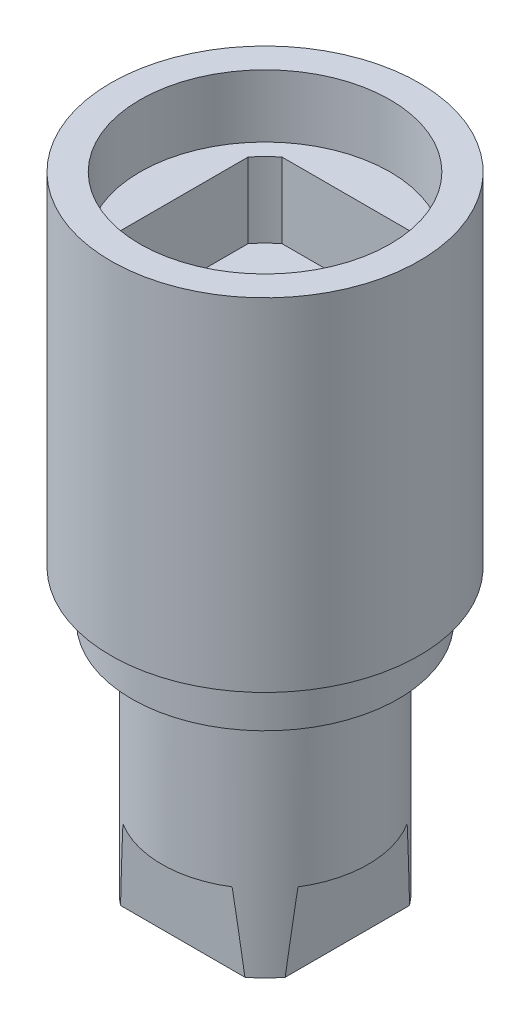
ISO-10303-21;
HEADER;
FILE_DESCRIPTION(('STEP AP214'),'2;1');
FILE_NAME('part.step','',(''),(''),'','','');
FILE_SCHEMA(('AUTOMOTIVE_DESIGN { 1 0 10303 214 1 1 1 1 }'));
ENDSEC;
DATA;
#1=APPLICATION_CONTEXT('core data for automotive mechanical design processes');
#2=APPLICATION_PROTOCOL_DEFINITION('international standard','automotive_design',2000,#1);
#3=PRODUCT_CONTEXT('',#1,'mechanical');
#4=PRODUCT('Part','Part','',(#3));
#5=PRODUCT_RELATED_PRODUCT_CATEGORY('part','',(#4));
#6=PRODUCT_DEFINITION_FORMATION('','',#4);
#7=PRODUCT_DEFINITION_CONTEXT('part definition',#1,'design');
#8=PRODUCT_DEFINITION('design','',#6,#7);
#9=PRODUCT_DEFINITION_SHAPE('','',#8);
#10=(LENGTH_UNIT() NAMED_UNIT(*) SI_UNIT(.MILLI.,.METRE.));
#11=(NAMED_UNIT(*) PLANE_ANGLE_UNIT() SI_UNIT($,.RADIAN.));
#12=(NAMED_UNIT(*) SI_UNIT($,.STERADIAN.) SOLID_ANGLE_UNIT());
#13=UNCERTAINTY_MEASURE_WITH_UNIT(LENGTH_MEASURE(1.E-05),#10,'distance_accuracy_value','');
#14=(GEOMETRIC_REPRESENTATION_CONTEXT(3) GLOBAL_UNCERTAINTY_ASSIGNED_CONTEXT((#13)) GLOBAL_UNIT_ASSIGNED_CONTEXT((#10,
#11,#12)) REPRESENTATION_CONTEXT('',''));
#15=CARTESIAN_POINT('',(0.,0.,0.));
#16=DIRECTION('',(0.,0.,1.));
#17=DIRECTION('',(1.,0.,0.));
#18=AXIS2_PLACEMENT_3D('',#15,#16,#17);
#19=CARTESIAN_POINT('',(0.,-13.6,0.));
#20=DIRECTION('',(0.,-1.,0.));
#21=DIRECTION('',(0.,0.,-1.));
#22=AXIS2_PLACEMENT_3D('',#19,#20,#21);
#23=PLANE('',#22);
#24=CARTESIAN_POINT('',(0.,-13.6,0.));
#25=DIRECTION('',(0.,1.,0.));
#26=DIRECTION('',(0.,0.,1.));
#27=AXIS2_PLACEMENT_3D('',#24,#25,#26);
#28=CIRCLE('',#27,3.1);
#29=CARTESIAN_POINT('',(-3.1,-13.6,0.));
#30=VERTEX_POINT('',#29);
#31=EDGE_CURVE('E32',#30,#30,#28,.T.);
#32=ORIENTED_EDGE('',*,*,#31,.T.);
#33=EDGE_LOOP('',(#32));
#34=FACE_BOUND('',#33,.T.);
#35=DIRECTION('',(0.,0.,1.));
#36=VECTOR('',#35,1.);
#37=CARTESIAN_POINT('',(-3.95,-13.6,8.88));
#38=LINE('',#37,#36);
#39=CARTESIAN_POINT('',(-3.95,-13.6,2.98328677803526));
#40=VERTEX_POINT('',#39);
#41=CARTESIAN_POINT('',(-3.95,-13.6,-2.98328677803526));
#42=VERTEX_POINT('',#41);
#43=EDGE_CURVE('E204',#40,#42,#38,.F.);
#44=ORIENTED_EDGE('',*,*,#43,.T.);
#45=CARTESIAN_POINT('',(0.,-13.6,0.));
#46=DIRECTION('',(0.,-1.,0.));
#47=DIRECTION('',(0.,0.,-1.));
#48=AXIS2_PLACEMENT_3D('',#45,#46,#47);
#49=CIRCLE('',#48,4.95);
#50=CARTESIAN_POINT('',(-2.98328677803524,-13.6,-3.95000000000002));
#51=VERTEX_POINT('',#50);
#52=EDGE_CURVE('E284',#42,#51,#49,.T.);
#53=ORIENTED_EDGE('',*,*,#52,.T.);
#54=DIRECTION('',(1.,0.,0.));
#55=VECTOR('',#54,1.);
#56=CARTESIAN_POINT('',(8.88,-13.6,-3.95000000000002));
#57=LINE('',#56,#55);
#58=CARTESIAN_POINT('',(2.98328677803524,-13.6,-3.95000000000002));
#59=VERTEX_POINT('',#58);
#60=EDGE_CURVE('E210',#51,#59,#57,.T.);
#61=ORIENTED_EDGE('',*,*,#60,.T.);
#62=CARTESIAN_POINT('',(0.,-13.6,0.));
#63=DIRECTION('',(0.,-1.,0.));
#64=DIRECTION('',(0.,0.,-1.));
#65=AXIS2_PLACEMENT_3D('',#62,#63,#64);
#66=CIRCLE('',#65,4.95);
#67=CARTESIAN_POINT('',(3.95000000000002,-13.6,-2.98328677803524));
#68=VERTEX_POINT('',#67);
#69=EDGE_CURVE('E19',#59,#68,#66,.T.);
#70=ORIENTED_EDGE('',*,*,#69,.T.);
#71=DIRECTION('',(0.,0.,1.));
#72=VECTOR('',#71,1.);
#73=CARTESIAN_POINT('',(3.95000000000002,-13.6,8.88));
#74=LINE('',#73,#72);
#75=CARTESIAN_POINT('',(3.95000000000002,-13.6,2.98328677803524));
#76=VERTEX_POINT('',#75);
#77=EDGE_CURVE('E215',#68,#76,#74,.T.);
#78=ORIENTED_EDGE('',*,*,#77,.T.);
#79=CARTESIAN_POINT('',(0.,-13.6,0.));
#80=DIRECTION('',(0.,-1.,0.));
#81=DIRECTION('',(0.,0.,-1.));
#82=AXIS2_PLACEMENT_3D('',#79,#80,#81);
#83=CIRCLE('',#82,4.95);
#84=CARTESIAN_POINT('',(2.98328677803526,-13.6,3.95));
#85=VERTEX_POINT('',#84);
#86=EDGE_CURVE('E287',#76,#85,#83,.T.);
#87=ORIENTED_EDGE('',*,*,#86,.T.);
#88=DIRECTION('',(1.,0.,0.));
#89=VECTOR('',#88,1.);
#90=CARTESIAN_POINT('',(8.88,-13.6,3.95));
#91=LINE('',#90,#89);
#92=CARTESIAN_POINT('',(-2.98328677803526,-13.6,3.95));
#93=VERTEX_POINT('',#92);
#94=EDGE_CURVE('E150',#85,#93,#91,.F.);
#95=ORIENTED_EDGE('',*,*,#94,.T.);
#96=CARTESIAN_POINT('',(0.,-13.6,0.));
#97=DIRECTION('',(0.,-1.,0.));
#98=DIRECTION('',(0.,0.,-1.));
#99=AXIS2_PLACEMENT_3D('',#96,#97,#98);
#100=CIRCLE('',#99,4.95);
#101=EDGE_CURVE('E286',#93,#40,#100,.T.);
#102=ORIENTED_EDGE('',*,*,#101,.T.);
#103=EDGE_LOOP('',(#44,#53,#61,#70,#78,#87,#95,#102));
#104=FACE_BOUND('',#103,.T.);
#105=ADVANCED_FACE('F16',(#34,#104),#23,.T.);
#106=CARTESIAN_POINT('',(0.,-13.6,0.));
#107=DIRECTION('',(0.,1.,0.));
#108=DIRECTION('',(0.,0.,1.));
#109=AXIS2_PLACEMENT_3D('',#106,#107,#108);
#110=CYLINDRICAL_SURFACE('',#109,3.1);
#111=ORIENTED_EDGE('',*,*,#31,.F.);
#112=EDGE_LOOP('',(#111));
#113=FACE_BOUND('',#112,.T.);
#114=CARTESIAN_POINT('',(0.,9.8,0.));
#115=DIRECTION('',(0.,1.,0.));
#116=DIRECTION('',(0.,0.,1.));
#117=AXIS2_PLACEMENT_3D('',#114,#115,#116);
#118=CIRCLE('',#117,3.1);
#119=CARTESIAN_POINT('',(-3.1,9.8,0.));
#120=VERTEX_POINT('',#119);
#121=EDGE_CURVE('E270',#120,#120,#118,.F.);
#122=ORIENTED_EDGE('',*,*,#121,.F.);
#123=EDGE_LOOP('',(#122));
#124=FACE_BOUND('',#123,.T.);
#125=ADVANCED_FACE('F300',(#113,#124),#110,.F.);
#126=CARTESIAN_POINT('',(8.88,-9.9,4.2));
#127=DIRECTION('',(0.,1.,0.));
#128=DIRECTION('',(0.,0.,1.));
#129=AXIS2_PLACEMENT_3D('',#126,#127,#128);
#130=PLANE('',#129);
#131=DIRECTION('',(1.,0.,0.));
#132=VECTOR('',#131,1.);
#133=CARTESIAN_POINT('',(8.88,-9.9,4.19999999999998));
#134=LINE('',#133,#132);
#135=CARTESIAN_POINT('',(-2.61963737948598,-9.9,4.19999999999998));
#136=VERTEX_POINT('',#135);
#137=CARTESIAN_POINT('',(2.61963737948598,-9.9,4.19999999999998));
#138=VERTEX_POINT('',#137);
#139=EDGE_CURVE('E202',#136,#138,#134,.T.);
#140=ORIENTED_EDGE('',*,*,#139,.T.);
#141=CARTESIAN_POINT('',(0.,-9.9,0.));
#142=DIRECTION('',(0.,-1.,0.));
#143=DIRECTION('',(0.,0.,-1.));
#144=AXIS2_PLACEMENT_3D('',#141,#142,#143);
#145=CIRCLE('',#144,4.95);
#146=EDGE_CURVE('E263',#136,#138,#145,.F.);
#147=ORIENTED_EDGE('',*,*,#146,.F.);
#148=EDGE_LOOP('',(#140,#147));
#149=FACE_BOUND('',#148,.T.);
#150=ADVANCED_FACE('F297',(#149),#130,.F.);
#151=CARTESIAN_POINT('',(4.95,-9.9,8.88));
#152=DIRECTION('',(0.,1.,0.));
#153=DIRECTION('',(0.,0.,1.));
#154=AXIS2_PLACEMENT_3D('',#151,#152,#153);
#155=PLANE('',#154);
#156=DIRECTION('',(0.,0.,1.));
#157=VECTOR('',#156,1.);
#158=CARTESIAN_POINT('',(4.2,-9.9,8.88));
#159=LINE('',#158,#157);
#160=CARTESIAN_POINT('',(4.2,-9.9,2.61963737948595));
#161=VERTEX_POINT('',#160);
#162=CARTESIAN_POINT('',(4.2,-9.9,-2.61963737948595));
#163=VERTEX_POINT('',#162);
#164=EDGE_CURVE('E82',#161,#163,#159,.F.);
#165=ORIENTED_EDGE('',*,*,#164,.T.);
#166=CARTESIAN_POINT('',(0.,-9.9,0.));
#167=DIRECTION('',(0.,-1.,0.));
#168=DIRECTION('',(0.,0.,-1.));
#169=AXIS2_PLACEMENT_3D('',#166,#167,#168);
#170=CIRCLE('',#169,4.95);
#171=EDGE_CURVE('E254',#161,#163,#170,.F.);
#172=ORIENTED_EDGE('',*,*,#171,.F.);
#173=EDGE_LOOP('',(#165,#172));
#174=FACE_BOUND('',#173,.T.);
#175=ADVANCED_FACE('F299',(#174),#155,.F.);
#176=CARTESIAN_POINT('',(4.2,-9.9,8.88));
#177=DIRECTION('',(-0.997725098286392,0.067413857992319,0.));
#178=DIRECTION('',(-0.067413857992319,-0.997725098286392,0.));
#179=AXIS2_PLACEMENT_3D('',#176,#177,#178);
#180=PLANE('',#179);
#181=CARTESIAN_POINT('',(0.,-72.0600000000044,0.));
#182=DIRECTION('',(-0.997725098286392,0.067413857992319,0.));
#183=DIRECTION('',(-0.067413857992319,-0.997725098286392,0.));
#184=AXIS2_PLACEMENT_3D('',#181,#182,#183);
#185=ELLIPSE('',#184,73.4270392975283,4.95);
#186=EDGE_CURVE('E252',#163,#68,#185,.T.);
#187=ORIENTED_EDGE('',*,*,#186,.F.);
#188=ORIENTED_EDGE('',*,*,#164,.F.);
#189=CARTESIAN_POINT('',(0.,-72.0600000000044,0.));
#190=DIRECTION('',(-0.997725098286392,0.067413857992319,0.));
#191=DIRECTION('',(-0.067413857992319,-0.997725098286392,0.));
#192=AXIS2_PLACEMENT_3D('',#189,#190,#191);
#193=ELLIPSE('',#192,73.4270392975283,4.95);
#194=EDGE_CURVE('E257',#76,#161,#193,.T.);
#195=ORIENTED_EDGE('',*,*,#194,.F.);
#196=ORIENTED_EDGE('',*,*,#77,.F.);
#197=EDGE_LOOP('',(#187,#188,#195,#196));
#198=FACE_BOUND('',#197,.T.);
#199=ADVANCED_FACE('F307',(#198),#180,.F.);
#200=CARTESIAN_POINT('',(8.88,-9.9,-4.95));
#201=DIRECTION('',(0.,1.,0.));
#202=DIRECTION('',(0.,0.,1.));
#203=AXIS2_PLACEMENT_3D('',#200,#201,#202);
#204=PLANE('',#203);
#205=DIRECTION('',(1.,0.,0.));
#206=VECTOR('',#205,1.);
#207=CARTESIAN_POINT('',(8.88,-9.9,-4.2));
#208=LINE('',#207,#206);
#209=CARTESIAN_POINT('',(2.61963737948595,-9.9,-4.2));
#210=VERTEX_POINT('',#209);
#211=CARTESIAN_POINT('',(-2.61963737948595,-9.9,-4.2));
#212=VERTEX_POINT('',#211);
#213=EDGE_CURVE('E212',#210,#212,#208,.F.);
#214=ORIENTED_EDGE('',*,*,#213,.T.);
#215=CARTESIAN_POINT('',(0.,-9.9,0.));
#216=DIRECTION('',(0.,-1.,0.));
#217=DIRECTION('',(0.,0.,-1.));
#218=AXIS2_PLACEMENT_3D('',#215,#216,#217);
#219=CIRCLE('',#218,4.95);
#220=EDGE_CURVE('E247',#210,#212,#219,.F.);
#221=ORIENTED_EDGE('',*,*,#220,.F.);
#222=EDGE_LOOP('',(#214,#221));
#223=FACE_BOUND('',#222,.T.);
#224=ADVANCED_FACE('F388',(#223),#204,.F.);
#225=CARTESIAN_POINT('',(8.88,-9.9,-4.2));
#226=DIRECTION('',(0.,0.067413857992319,0.997725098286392));
#227=DIRECTION('',(0.,-0.997725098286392,0.067413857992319));
#228=AXIS2_PLACEMENT_3D('',#225,#226,#227);
#229=PLANE('',#228);
#230=CARTESIAN_POINT('',(0.,-72.0600000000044,0.));
#231=DIRECTION('',(0.,0.067413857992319,0.997725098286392));
#232=DIRECTION('',(0.,-0.997725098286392,0.067413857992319));
#233=AXIS2_PLACEMENT_3D('',#230,#231,#232);
#234=ELLIPSE('',#233,73.4270392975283,4.95);
#235=EDGE_CURVE('E244',#212,#51,#234,.T.);
#236=ORIENTED_EDGE('',*,*,#235,.F.);
#237=ORIENTED_EDGE('',*,*,#213,.F.);
#238=CARTESIAN_POINT('',(0.,-72.0600000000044,0.));
#239=DIRECTION('',(0.,0.067413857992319,0.997725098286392));
#240=DIRECTION('',(0.,-0.997725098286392,0.067413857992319));
#241=AXIS2_PLACEMENT_3D('',#238,#239,#240);
#242=ELLIPSE('',#241,73.4270392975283,4.95);
#243=EDGE_CURVE('E250',#59,#210,#242,.T.);
#244=ORIENTED_EDGE('',*,*,#243,.F.);
#245=ORIENTED_EDGE('',*,*,#60,.F.);
#246=EDGE_LOOP('',(#236,#237,#244,#245));
#247=FACE_BOUND('',#246,.T.);
#248=ADVANCED_FACE('F384',(#247),#229,.F.);
#249=CARTESIAN_POINT('',(-4.2,-9.9,8.88));
#250=DIRECTION('',(0.,1.,0.));
#251=DIRECTION('',(0.,0.,1.));
#252=AXIS2_PLACEMENT_3D('',#249,#250,#251);
#253=PLANE('',#252);
#254=DIRECTION('',(0.,0.,1.));
#255=VECTOR('',#254,1.);
#256=CARTESIAN_POINT('',(-4.19999999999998,-9.9,8.88));
#257=LINE('',#256,#255);
#258=CARTESIAN_POINT('',(-4.19999999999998,-9.9,-2.61963737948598));
#259=VERTEX_POINT('',#258);
#260=CARTESIAN_POINT('',(-4.19999999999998,-9.9,2.61963737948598));
#261=VERTEX_POINT('',#260);
#262=EDGE_CURVE('E207',#259,#261,#257,.T.);
#263=ORIENTED_EDGE('',*,*,#262,.T.);
#264=CARTESIAN_POINT('',(0.,-9.9,0.));
#265=DIRECTION('',(0.,-1.,0.));
#266=DIRECTION('',(0.,0.,-1.));
#267=AXIS2_PLACEMENT_3D('',#264,#265,#266);
#268=CIRCLE('',#267,4.95);
#269=EDGE_CURVE('E238',#259,#261,#268,.F.);
#270=ORIENTED_EDGE('',*,*,#269,.F.);
#271=EDGE_LOOP('',(#263,#270));
#272=FACE_BOUND('',#271,.T.);
#273=ADVANCED_FACE('F380',(#272),#253,.F.);
#274=CARTESIAN_POINT('',(-3.95,-13.6,8.88));
#275=DIRECTION('',(0.997725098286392,0.067413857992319,0.));
#276=DIRECTION('',(-0.067413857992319,0.997725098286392,0.));
#277=AXIS2_PLACEMENT_3D('',#274,#275,#276);
#278=PLANE('',#277);
#279=CARTESIAN_POINT('',(0.,-72.0600000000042,0.));
#280=DIRECTION('',(0.997725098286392,0.067413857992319,0.));
#281=DIRECTION('',(0.067413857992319,-0.997725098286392,0.));
#282=AXIS2_PLACEMENT_3D('',#279,#280,#281);
#283=ELLIPSE('',#282,73.4270392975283,4.95);
#284=EDGE_CURVE('E235',#261,#40,#283,.T.);
#285=ORIENTED_EDGE('',*,*,#284,.F.);
#286=ORIENTED_EDGE('',*,*,#262,.F.);
#287=CARTESIAN_POINT('',(0.,-72.0600000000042,0.));
#288=DIRECTION('',(0.997725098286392,0.067413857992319,0.));
#289=DIRECTION('',(0.067413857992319,-0.997725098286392,0.));
#290=AXIS2_PLACEMENT_3D('',#287,#288,#289);
#291=ELLIPSE('',#290,73.4270392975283,4.95);
#292=EDGE_CURVE('E241',#42,#259,#291,.T.);
#293=ORIENTED_EDGE('',*,*,#292,.F.);
#294=ORIENTED_EDGE('',*,*,#43,.F.);
#295=EDGE_LOOP('',(#285,#286,#293,#294));
#296=FACE_BOUND('',#295,.T.);
#297=ADVANCED_FACE('F377',(#296),#278,.F.);
#298=CARTESIAN_POINT('',(8.88,-13.6,3.95));
#299=DIRECTION('',(0.,0.067413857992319,-0.997725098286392));
#300=DIRECTION('',(0.,0.997725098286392,0.067413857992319));
#301=AXIS2_PLACEMENT_3D('',#298,#299,#300);
#302=PLANE('',#301);
#303=CARTESIAN_POINT('',(0.,-72.0600000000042,0.));
#304=DIRECTION('',(0.,0.067413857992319,-0.997725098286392));
#305=DIRECTION('',(0.,-0.997725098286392,-0.067413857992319));
#306=AXIS2_PLACEMENT_3D('',#303,#304,#305);
#307=ELLIPSE('',#306,73.4270392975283,4.95);
#308=EDGE_CURVE('E260',#138,#85,#307,.T.);
#309=ORIENTED_EDGE('',*,*,#308,.F.);
#310=ORIENTED_EDGE('',*,*,#139,.F.);
#311=CARTESIAN_POINT('',(0.,-72.0600000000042,0.));
#312=DIRECTION('',(0.,0.067413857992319,-0.997725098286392));
#313=DIRECTION('',(0.,-0.997725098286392,-0.067413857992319));
#314=AXIS2_PLACEMENT_3D('',#311,#312,#313);
#315=ELLIPSE('',#314,73.4270392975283,4.95);
#316=EDGE_CURVE('E192',#93,#136,#315,.T.);
#317=ORIENTED_EDGE('',*,*,#316,.F.);
#318=ORIENTED_EDGE('',*,*,#94,.F.);
#319=EDGE_LOOP('',(#309,#310,#317,#318));
#320=FACE_BOUND('',#319,.T.);
#321=ADVANCED_FACE('F293',(#320),#302,.F.);
#322=CARTESIAN_POINT('',(0.,16.4,0.));
#323=DIRECTION('',(0.,1.,0.));
#324=DIRECTION('',(0.,0.,1.));
#325=AXIS2_PLACEMENT_3D('',#322,#323,#324);
#326=CYLINDRICAL_SURFACE('',#325,5.15);
#327=DIRECTION('',(0.,1.,0.));
#328=VECTOR('',#327,1.);
#329=CARTESIAN_POINT('',(-3.212767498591,16.4,4.025));
#330=LINE('',#329,#328);
#331=CARTESIAN_POINT('',(-3.21276749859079,13.4,4.025));
#332=VERTEX_POINT('',#331);
#333=CARTESIAN_POINT('',(-3.21276749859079,9.8,4.025));
#334=VERTEX_POINT('',#333);
#335=EDGE_CURVE('E160',#332,#334,#330,.F.);
#336=ORIENTED_EDGE('',*,*,#335,.T.);
#337=CARTESIAN_POINT('',(0.,9.8,0.));
#338=DIRECTION('',(0.,1.,0.));
#339=DIRECTION('',(0.,0.,1.));
#340=AXIS2_PLACEMENT_3D('',#337,#338,#339);
#341=CIRCLE('',#340,5.15);
#342=CARTESIAN_POINT('',(-4.025,9.8,3.21276749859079));
#343=VERTEX_POINT('',#342);
#344=EDGE_CURVE('E156',#343,#334,#341,.T.);
#345=ORIENTED_EDGE('',*,*,#344,.F.);
#346=DIRECTION('',(0.,1.,0.));
#347=VECTOR('',#346,1.);
#348=CARTESIAN_POINT('',(-4.025,16.4,3.212767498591));
#349=LINE('',#348,#347);
#350=CARTESIAN_POINT('',(-4.025,13.4,3.21276749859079));
#351=VERTEX_POINT('',#350);
#352=EDGE_CURVE('E153',#343,#351,#349,.T.);
#353=ORIENTED_EDGE('',*,*,#352,.T.);
#354=CARTESIAN_POINT('',(0.,13.4,0.));
#355=DIRECTION('',(0.,1.,0.));
#356=DIRECTION('',(0.,0.,1.));
#357=AXIS2_PLACEMENT_3D('',#354,#355,#356);
#358=CIRCLE('',#357,5.15);
#359=EDGE_CURVE('E138',#332,#351,#358,.F.);
#360=ORIENTED_EDGE('',*,*,#359,.F.);
#361=EDGE_LOOP('',(#336,#345,#353,#360));
#362=FACE_BOUND('',#361,.T.);
#363=ADVANCED_FACE('F154',(#362),#326,.F.);
#364=CARTESIAN_POINT('',(0.,16.4,0.));
#365=DIRECTION('',(0.,1.,0.));
#366=DIRECTION('',(0.,0.,1.));
#367=AXIS2_PLACEMENT_3D('',#364,#365,#366);
#368=CYLINDRICAL_SURFACE('',#367,5.15);
#369=DIRECTION('',(0.,1.,0.));
#370=VECTOR('',#369,1.);
#371=CARTESIAN_POINT('',(4.025,16.4,3.212767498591));
#372=LINE('',#371,#370);
#373=CARTESIAN_POINT('',(4.025,13.4,3.21276749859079));
#374=VERTEX_POINT('',#373);
#375=CARTESIAN_POINT('',(4.025,9.8,3.21276749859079));
#376=VERTEX_POINT('',#375);
#377=EDGE_CURVE('E182',#374,#376,#372,.F.);
#378=ORIENTED_EDGE('',*,*,#377,.T.);
#379=CARTESIAN_POINT('',(0.,9.8,0.));
#380=DIRECTION('',(0.,1.,0.));
#381=DIRECTION('',(0.,0.,1.));
#382=AXIS2_PLACEMENT_3D('',#379,#380,#381);
#383=CIRCLE('',#382,5.15);
#384=CARTESIAN_POINT('',(3.21276749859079,9.8,4.025));
#385=VERTEX_POINT('',#384);
#386=EDGE_CURVE('E276',#385,#376,#383,.T.);
#387=ORIENTED_EDGE('',*,*,#386,.F.);
#388=DIRECTION('',(0.,1.,0.));
#389=VECTOR('',#388,1.);
#390=CARTESIAN_POINT('',(3.212767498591,16.4,4.025));
#391=LINE('',#390,#389);
#392=CARTESIAN_POINT('',(3.21276749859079,13.4,4.025));
#393=VERTEX_POINT('',#392);
#394=EDGE_CURVE('E185',#385,#393,#391,.T.);
#395=ORIENTED_EDGE('',*,*,#394,.T.);
#396=CARTESIAN_POINT('',(0.,13.4,0.));
#397=DIRECTION('',(0.,1.,0.));
#398=DIRECTION('',(0.,0.,1.));
#399=AXIS2_PLACEMENT_3D('',#396,#397,#398);
#400=CIRCLE('',#399,5.15);
#401=EDGE_CURVE('E149',#374,#393,#400,.F.);
#402=ORIENTED_EDGE('',*,*,#401,.F.);
#403=EDGE_LOOP('',(#378,#387,#395,#402));
#404=FACE_BOUND('',#403,.T.);
#405=ADVANCED_FACE('F368',(#404),#368,.F.);
#406=CARTESIAN_POINT('',(0.,16.4,0.));
#407=DIRECTION('',(0.,1.,0.));
#408=DIRECTION('',(0.,0.,1.));
#409=AXIS2_PLACEMENT_3D('',#406,#407,#408);
#410=CYLINDRICAL_SURFACE('',#409,5.15);
#411=DIRECTION('',(0.,1.,0.));
#412=VECTOR('',#411,1.);
#413=CARTESIAN_POINT('',(3.212767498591,16.4,-4.025));
#414=LINE('',#413,#412);
#415=CARTESIAN_POINT('',(3.21276749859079,13.4,-4.025));
#416=VERTEX_POINT('',#415);
#417=CARTESIAN_POINT('',(3.21276749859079,9.8,-4.025));
#418=VERTEX_POINT('',#417);
#419=EDGE_CURVE('E176',#416,#418,#414,.F.);
#420=ORIENTED_EDGE('',*,*,#419,.T.);
#421=CARTESIAN_POINT('',(0.,9.8,0.));
#422=DIRECTION('',(0.,1.,0.));
#423=DIRECTION('',(0.,0.,1.));
#424=AXIS2_PLACEMENT_3D('',#421,#422,#423);
#425=CIRCLE('',#424,5.15);
#426=CARTESIAN_POINT('',(4.025,9.8,-3.21276749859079));
#427=VERTEX_POINT('',#426);
#428=EDGE_CURVE('E273',#427,#418,#425,.T.);
#429=ORIENTED_EDGE('',*,*,#428,.F.);
#430=DIRECTION('',(0.,1.,0.));
#431=VECTOR('',#430,1.);
#432=CARTESIAN_POINT('',(4.025,16.4,-3.212767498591));
#433=LINE('',#432,#431);
#434=CARTESIAN_POINT('',(4.025,13.4,-3.21276749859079));
#435=VERTEX_POINT('',#434);
#436=EDGE_CURVE('E179',#427,#435,#433,.T.);
#437=ORIENTED_EDGE('',*,*,#436,.T.);
#438=CARTESIAN_POINT('',(0.,13.4,0.));
#439=DIRECTION('',(0.,1.,0.));
#440=DIRECTION('',(0.,0.,1.));
#441=AXIS2_PLACEMENT_3D('',#438,#439,#440);
#442=CIRCLE('',#441,5.15);
#443=EDGE_CURVE('E280',#416,#435,#442,.F.);
#444=ORIENTED_EDGE('',*,*,#443,.F.);
#445=EDGE_LOOP('',(#420,#429,#437,#444));
#446=FACE_BOUND('',#445,.T.);
#447=ADVANCED_FACE('F364',(#446),#410,.F.);
#448=CARTESIAN_POINT('',(0.,9.8,0.));
#449=DIRECTION('',(0.,1.,0.));
#450=DIRECTION('',(0.,0.,1.));
#451=AXIS2_PLACEMENT_3D('',#448,#449,#450);
#452=PLANE('',#451);
#453=ORIENTED_EDGE('',*,*,#121,.T.);
#454=EDGE_LOOP('',(#453));
#455=FACE_BOUND('',#454,.T.);
#456=DIRECTION('',(0.,0.,-1.));
#457=VECTOR('',#456,1.);
#458=CARTESIAN_POINT('',(4.025,9.8,3.212767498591));
#459=LINE('',#458,#457);
#460=EDGE_CURVE('E184',#376,#427,#459,.T.);
#461=ORIENTED_EDGE('',*,*,#460,.T.);
#462=ORIENTED_EDGE('',*,*,#428,.T.);
#463=DIRECTION('',(-1.,0.,0.));
#464=VECTOR('',#463,1.);
#465=CARTESIAN_POINT('',(3.212767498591,9.8,-4.025));
#466=LINE('',#465,#464);
#467=CARTESIAN_POINT('',(-3.21276749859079,9.8,-4.025));
#468=VERTEX_POINT('',#467);
#469=EDGE_CURVE('E178',#418,#468,#466,.T.);
#470=ORIENTED_EDGE('',*,*,#469,.T.);
#471=CARTESIAN_POINT('',(0.,9.8,0.));
#472=DIRECTION('',(0.,1.,0.));
#473=DIRECTION('',(0.,0.,1.));
#474=AXIS2_PLACEMENT_3D('',#471,#472,#473);
#475=CIRCLE('',#474,5.15);
#476=CARTESIAN_POINT('',(-4.025,9.8,-3.21276749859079));
#477=VERTEX_POINT('',#476);
#478=EDGE_CURVE('E268',#468,#477,#475,.T.);
#479=ORIENTED_EDGE('',*,*,#478,.T.);
#480=DIRECTION('',(0.,0.,1.));
#481=VECTOR('',#480,1.);
#482=CARTESIAN_POINT('',(-4.025,9.8,-3.212767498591));
#483=LINE('',#482,#481);
#484=EDGE_CURVE('E161',#477,#343,#483,.T.);
#485=ORIENTED_EDGE('',*,*,#484,.T.);
#486=ORIENTED_EDGE('',*,*,#344,.T.);
#487=DIRECTION('',(1.,0.,0.));
#488=VECTOR('',#487,1.);
#489=CARTESIAN_POINT('',(-3.212767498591,9.8,4.025));
#490=LINE('',#489,#488);
#491=EDGE_CURVE('E189',#334,#385,#490,.T.);
#492=ORIENTED_EDGE('',*,*,#491,.T.);
#493=ORIENTED_EDGE('',*,*,#386,.T.);
#494=EDGE_LOOP('',(#461,#462,#470,#479,#485,#486,#492,#493));
#495=FACE_BOUND('',#494,.T.);
#496=ADVANCED_FACE('F360',(#455,#495),#452,.T.);
#497=CARTESIAN_POINT('',(0.,16.4,0.));
#498=DIRECTION('',(0.,1.,0.));
#499=DIRECTION('',(0.,0.,1.));
#500=AXIS2_PLACEMENT_3D('',#497,#498,#499);
#501=CYLINDRICAL_SURFACE('',#500,5.15);
#502=DIRECTION('',(0.,1.,0.));
#503=VECTOR('',#502,1.);
#504=CARTESIAN_POINT('',(-4.025,16.4,-3.212767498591));
#505=LINE('',#504,#503);
#506=CARTESIAN_POINT('',(-4.025,13.4,-3.21276749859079));
#507=VERTEX_POINT('',#506);
#508=EDGE_CURVE('E166',#507,#477,#505,.F.);
#509=ORIENTED_EDGE('',*,*,#508,.T.);
#510=ORIENTED_EDGE('',*,*,#478,.F.);
#511=DIRECTION('',(0.,1.,0.));
#512=VECTOR('',#511,1.);
#513=CARTESIAN_POINT('',(-3.212767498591,16.4,-4.025));
#514=LINE('',#513,#512);
#515=CARTESIAN_POINT('',(-3.21276749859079,13.4,-4.025));
#516=VERTEX_POINT('',#515);
#517=EDGE_CURVE('E172',#468,#516,#514,.T.);
#518=ORIENTED_EDGE('',*,*,#517,.T.);
#519=CARTESIAN_POINT('',(0.,13.4,0.));
#520=DIRECTION('',(0.,1.,0.));
#521=DIRECTION('',(0.,0.,1.));
#522=AXIS2_PLACEMENT_3D('',#519,#520,#521);
#523=CIRCLE('',#522,5.15);
#524=EDGE_CURVE('E266',#507,#516,#523,.F.);
#525=ORIENTED_EDGE('',*,*,#524,.F.);
#526=EDGE_LOOP('',(#509,#510,#518,#525));
#527=FACE_BOUND('',#526,.T.);
#528=ADVANCED_FACE('F356',(#527),#501,.F.);
#529=CARTESIAN_POINT('',(0.,-2.3,0.));
#530=DIRECTION('',(0.,-1.,0.));
#531=DIRECTION('',(0.,0.,-1.));
#532=AXIS2_PLACEMENT_3D('',#529,#530,#531);
#533=CYLINDRICAL_SURFACE('',#532,4.95);
#534=CARTESIAN_POINT('',(0.,-2.3,0.));
#535=DIRECTION('',(0.,-1.,0.));
#536=DIRECTION('',(0.,0.,-1.));
#537=AXIS2_PLACEMENT_3D('',#534,#535,#536);
#538=CIRCLE('',#537,4.95);
#539=CARTESIAN_POINT('',(0.,-2.3,4.95));
#540=VERTEX_POINT('',#539);
#541=EDGE_CURVE('E167',#540,#540,#538,.F.);
#542=ORIENTED_EDGE('',*,*,#541,.F.);
#543=EDGE_LOOP('',(#542));
#544=FACE_BOUND('',#543,.T.);
#545=ORIENTED_EDGE('',*,*,#101,.F.);
#546=ORIENTED_EDGE('',*,*,#316,.T.);
#547=ORIENTED_EDGE('',*,*,#146,.T.);
#548=ORIENTED_EDGE('',*,*,#308,.T.);
#549=ORIENTED_EDGE('',*,*,#86,.F.);
#550=ORIENTED_EDGE('',*,*,#194,.T.);
#551=ORIENTED_EDGE('',*,*,#171,.T.);
#552=ORIENTED_EDGE('',*,*,#186,.T.);
#553=ORIENTED_EDGE('',*,*,#69,.F.);
#554=ORIENTED_EDGE('',*,*,#243,.T.);
#555=ORIENTED_EDGE('',*,*,#220,.T.);
#556=ORIENTED_EDGE('',*,*,#235,.T.);
#557=ORIENTED_EDGE('',*,*,#52,.F.);
#558=ORIENTED_EDGE('',*,*,#292,.T.);
#559=ORIENTED_EDGE('',*,*,#269,.T.);
#560=ORIENTED_EDGE('',*,*,#284,.T.);
#561=EDGE_LOOP('',(#545,#546,#547,#548,#549,#550,#551,#552,#553,#554,#555,#556,#557,#558,#559,#560));
#562=FACE_BOUND('',#561,.T.);
#563=ADVANCED_FACE('F295',(#544,#562),#533,.T.);
#564=CARTESIAN_POINT('',(-4.025,16.4,-3.212767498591));
#565=DIRECTION('',(-1.,0.,0.));
#566=DIRECTION('',(0.,0.,1.));
#567=AXIS2_PLACEMENT_3D('',#564,#565,#566);
#568=PLANE('',#567);
#569=ORIENTED_EDGE('',*,*,#352,.F.);
#570=ORIENTED_EDGE('',*,*,#484,.F.);
#571=ORIENTED_EDGE('',*,*,#508,.F.);
#572=DIRECTION('',(0.,0.,-1.));
#573=VECTOR('',#572,1.);
#574=CARTESIAN_POINT('',(-4.025,13.4,0.));
#575=LINE('',#574,#573);
#576=EDGE_CURVE('E146',#507,#351,#575,.F.);
#577=ORIENTED_EDGE('',*,*,#576,.T.);
#578=EDGE_LOOP('',(#569,#570,#571,#577));
#579=FACE_BOUND('',#578,.T.);
#580=ADVANCED_FACE('F164',(#579),#568,.F.);
#581=CARTESIAN_POINT('',(-3.212767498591,16.4,4.025));
#582=DIRECTION('',(0.,0.,1.));
#583=DIRECTION('',(1.,0.,0.));
#584=AXIS2_PLACEMENT_3D('',#581,#582,#583);
#585=PLANE('',#584);
#586=ORIENTED_EDGE('',*,*,#394,.F.);
#587=ORIENTED_EDGE('',*,*,#491,.F.);
#588=ORIENTED_EDGE('',*,*,#335,.F.);
#589=DIRECTION('',(1.,0.,0.));
#590=VECTOR('',#589,1.);
#591=CARTESIAN_POINT('',(0.,13.4,4.025));
#592=LINE('',#591,#590);
#593=EDGE_CURVE('E148',#332,#393,#592,.T.);
#594=ORIENTED_EDGE('',*,*,#593,.T.);
#595=EDGE_LOOP('',(#586,#587,#588,#594));
#596=FACE_BOUND('',#595,.T.);
#597=ADVANCED_FACE('F347',(#596),#585,.F.);
#598=CARTESIAN_POINT('',(4.025,16.4,3.212767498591));
#599=DIRECTION('',(1.,0.,0.));
#600=DIRECTION('',(0.,0.,-1.));
#601=AXIS2_PLACEMENT_3D('',#598,#599,#600);
#602=PLANE('',#601);
#603=ORIENTED_EDGE('',*,*,#436,.F.);
#604=ORIENTED_EDGE('',*,*,#460,.F.);
#605=ORIENTED_EDGE('',*,*,#377,.F.);
#606=DIRECTION('',(0.,0.,-1.));
#607=VECTOR('',#606,1.);
#608=CARTESIAN_POINT('',(4.025,13.4,0.));
#609=LINE('',#608,#607);
#610=EDGE_CURVE('E169',#374,#435,#609,.T.);
#611=ORIENTED_EDGE('',*,*,#610,.T.);
#612=EDGE_LOOP('',(#603,#604,#605,#611));
#613=FACE_BOUND('',#612,.T.);
#614=ADVANCED_FACE('F343',(#613),#602,.F.);
#615=CARTESIAN_POINT('',(3.212767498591,16.4,-4.025));
#616=DIRECTION('',(0.,0.,-1.));
#617=DIRECTION('',(-1.,0.,0.));
#618=AXIS2_PLACEMENT_3D('',#615,#616,#617);
#619=PLANE('',#618);
#620=ORIENTED_EDGE('',*,*,#517,.F.);
#621=ORIENTED_EDGE('',*,*,#469,.F.);
#622=ORIENTED_EDGE('',*,*,#419,.F.);
#623=DIRECTION('',(1.,0.,0.));
#624=VECTOR('',#623,1.);
#625=CARTESIAN_POINT('',(0.,13.4,-4.025));
#626=LINE('',#625,#624);
#627=EDGE_CURVE('E231',#416,#516,#626,.F.);
#628=ORIENTED_EDGE('',*,*,#627,.T.);
#629=EDGE_LOOP('',(#620,#621,#622,#628));
#630=FACE_BOUND('',#629,.T.);
#631=ADVANCED_FACE('F339',(#630),#619,.F.);
#632=CARTESIAN_POINT('',(0.,-2.3,0.));
#633=DIRECTION('',(0.,-1.,0.));
#634=DIRECTION('',(0.,0.,-1.));
#635=AXIS2_PLACEMENT_3D('',#632,#633,#634);
#636=PLANE('',#635);
#637=ORIENTED_EDGE('',*,*,#541,.T.);
#638=EDGE_LOOP('',(#637));
#639=FACE_BOUND('',#638,.T.);
#640=CARTESIAN_POINT('',(0.,-2.3,0.));
#641=DIRECTION('',(0.,-1.,0.));
#642=DIRECTION('',(0.,0.,-1.));
#643=AXIS2_PLACEMENT_3D('',#640,#641,#642);
#644=CIRCLE('',#643,6.4);
#645=CARTESIAN_POINT('',(0.,-2.3,-6.4));
#646=VERTEX_POINT('',#645);
#647=EDGE_CURVE('E229',#646,#646,#644,.F.);
#648=ORIENTED_EDGE('',*,*,#647,.F.);
#649=EDGE_LOOP('',(#648));
#650=FACE_BOUND('',#649,.T.);
#651=ADVANCED_FACE('F336',(#639,#650),#636,.T.);
#652=CARTESIAN_POINT('',(0.,13.4,0.));
#653=DIRECTION('',(0.,-1.,0.));
#654=DIRECTION('',(0.,0.,-1.));
#655=AXIS2_PLACEMENT_3D('',#652,#653,#654);
#656=PLANE('',#655);
#657=ORIENTED_EDGE('',*,*,#443,.T.);
#658=ORIENTED_EDGE('',*,*,#610,.F.);
#659=ORIENTED_EDGE('',*,*,#401,.T.);
#660=ORIENTED_EDGE('',*,*,#593,.F.);
#661=ORIENTED_EDGE('',*,*,#359,.T.);
#662=ORIENTED_EDGE('',*,*,#576,.F.);
#663=ORIENTED_EDGE('',*,*,#524,.T.);
#664=ORIENTED_EDGE('',*,*,#627,.F.);
#665=EDGE_LOOP('',(#657,#658,#659,#660,#661,#662,#663,#664));
#666=FACE_BOUND('',#665,.T.);
#667=CARTESIAN_POINT('',(0.,13.4,0.));
#668=DIRECTION('',(0.,-1.,0.));
#669=DIRECTION('',(0.,0.,-1.));
#670=AXIS2_PLACEMENT_3D('',#667,#668,#669);
#671=CIRCLE('',#670,6.);
#672=CARTESIAN_POINT('',(-6.,13.4,0.));
#673=VERTEX_POINT('',#672);
#674=EDGE_CURVE('E226',#673,#673,#671,.F.);
#675=ORIENTED_EDGE('',*,*,#674,.T.);
#676=EDGE_LOOP('',(#675));
#677=FACE_BOUND('',#676,.T.);
#678=ADVANCED_FACE('F143',(#666,#677),#656,.F.);
#679=CARTESIAN_POINT('',(0.,0.,0.));
#680=DIRECTION('',(0.,-1.,0.));
#681=DIRECTION('',(0.,0.,-1.));
#682=AXIS2_PLACEMENT_3D('',#679,#680,#681);
#683=CYLINDRICAL_SURFACE('',#682,6.4);
#684=ORIENTED_EDGE('',*,*,#647,.T.);
#685=EDGE_LOOP('',(#684));
#686=FACE_BOUND('',#685,.T.);
#687=CARTESIAN_POINT('',(0.,0.,0.));
#688=DIRECTION('',(0.,-1.,0.));
#689=DIRECTION('',(0.,0.,-1.));
#690=AXIS2_PLACEMENT_3D('',#687,#688,#689);
#691=CIRCLE('',#690,6.4);
#692=CARTESIAN_POINT('',(0.,0.,-6.4));
#693=VERTEX_POINT('',#692);
#694=EDGE_CURVE('E223',#693,#693,#691,.T.);
#695=ORIENTED_EDGE('',*,*,#694,.T.);
#696=EDGE_LOOP('',(#695));
#697=FACE_BOUND('',#696,.T.);
#698=ADVANCED_FACE('F329',(#686,#697),#683,.T.);
#699=CARTESIAN_POINT('',(0.,16.4,0.));
#700=DIRECTION('',(0.,-1.,0.));
#701=DIRECTION('',(0.,0.,-1.));
#702=AXIS2_PLACEMENT_3D('',#699,#700,#701);
#703=CYLINDRICAL_SURFACE('',#702,6.);
#704=ORIENTED_EDGE('',*,*,#674,.F.);
#705=EDGE_LOOP('',(#704));
#706=FACE_BOUND('',#705,.T.);
#707=CARTESIAN_POINT('',(0.,16.4,0.));
#708=DIRECTION('',(0.,-1.,0.));
#709=DIRECTION('',(0.,0.,-1.));
#710=AXIS2_PLACEMENT_3D('',#707,#708,#709);
#711=CIRCLE('',#710,6.);
#712=CARTESIAN_POINT('',(-6.,16.4,0.));
#713=VERTEX_POINT('',#712);
#714=EDGE_CURVE('E220',#713,#713,#711,.T.);
#715=ORIENTED_EDGE('',*,*,#714,.F.);
#716=EDGE_LOOP('',(#715));
#717=FACE_BOUND('',#716,.T.);
#718=ADVANCED_FACE('F325',(#706,#717),#703,.F.);
#719=CARTESIAN_POINT('',(0.,0.,0.));
#720=DIRECTION('',(0.,1.,0.));
#721=DIRECTION('',(0.,0.,1.));
#722=AXIS2_PLACEMENT_3D('',#719,#720,#721);
#723=PLANE('',#722);
#724=ORIENTED_EDGE('',*,*,#694,.F.);
#725=EDGE_LOOP('',(#724));
#726=FACE_BOUND('',#725,.T.);
#727=CARTESIAN_POINT('',(0.,0.,0.));
#728=DIRECTION('',(0.,1.,0.));
#729=DIRECTION('',(0.,0.,1.));
#730=AXIS2_PLACEMENT_3D('',#727,#728,#729);
#731=CIRCLE('',#730,7.4);
#732=CARTESIAN_POINT('',(-7.4,0.,0.));
#733=VERTEX_POINT('',#732);
#734=EDGE_CURVE('E25',#733,#733,#731,.T.);
#735=ORIENTED_EDGE('',*,*,#734,.F.);
#736=EDGE_LOOP('',(#735));
#737=FACE_BOUND('',#736,.T.);
#738=ADVANCED_FACE('F318',(#726,#737),#723,.F.);
#739=CARTESIAN_POINT('',(0.,16.4,0.));
#740=DIRECTION('',(0.,1.,0.));
#741=DIRECTION('',(0.,0.,1.));
#742=AXIS2_PLACEMENT_3D('',#739,#740,#741);
#743=PLANE('',#742);
#744=ORIENTED_EDGE('',*,*,#714,.T.);
#745=EDGE_LOOP('',(#744));
#746=FACE_BOUND('',#745,.T.);
#747=CARTESIAN_POINT('',(0.,16.4,0.));
#748=DIRECTION('',(0.,1.,0.));
#749=DIRECTION('',(0.,0.,1.));
#750=AXIS2_PLACEMENT_3D('',#747,#748,#749);
#751=CIRCLE('',#750,7.4);
#752=CARTESIAN_POINT('',(-7.4,16.4,0.));
#753=VERTEX_POINT('',#752);
#754=EDGE_CURVE('E11',#753,#753,#751,.F.);
#755=ORIENTED_EDGE('',*,*,#754,.F.);
#756=EDGE_LOOP('',(#755));
#757=FACE_BOUND('',#756,.T.);
#758=ADVANCED_FACE('F312',(#746,#757),#743,.T.);
#759=CARTESIAN_POINT('',(0.,0.,0.));
#760=DIRECTION('',(0.,1.,0.));
#761=DIRECTION('',(0.,0.,1.));
#762=AXIS2_PLACEMENT_3D('',#759,#760,#761);
#763=CYLINDRICAL_SURFACE('',#762,7.4);
#764=ORIENTED_EDGE('',*,*,#754,.T.);
#765=EDGE_LOOP('',(#764));
#766=FACE_BOUND('',#765,.T.);
#767=ORIENTED_EDGE('',*,*,#734,.T.);
#768=EDGE_LOOP('',(#767));
#769=FACE_BOUND('',#768,.T.);
#770=ADVANCED_FACE('F310',(#766,#769),#763,.T.);
#771=CLOSED_SHELL('',(#105,#125,#150,#175,#199,#224,#248,#273,#297,#321,#363,#405,#447,#496,
#528,#563,#580,#597,#614,#631,#651,#678,#698,#718,#738,#758,#770));
#772=MANIFOLD_SOLID_BREP('B1',#771);
#773=ADVANCED_BREP_SHAPE_REPRESENTATION('',(#18,#772),#14);
#774=SHAPE_DEFINITION_REPRESENTATION(#9,#773);
ENDSEC;
END-ISO-10303-21;
